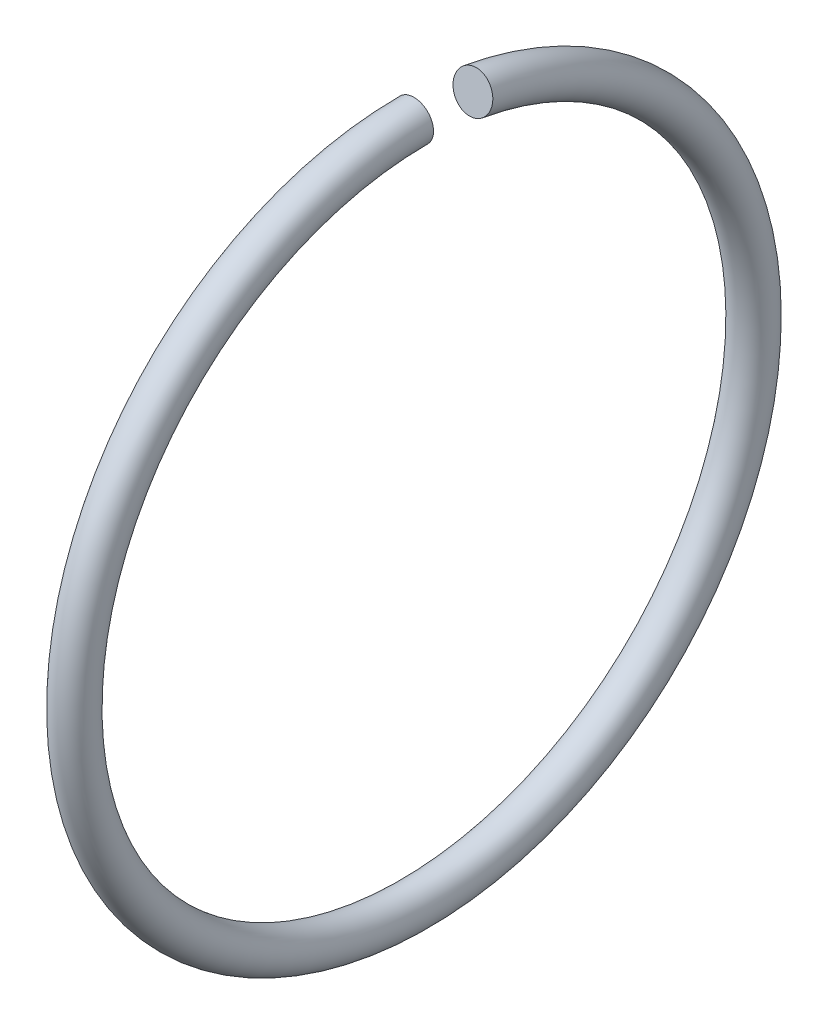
ISO-10303-21;
HEADER;
FILE_DESCRIPTION(('STEP AP214'),'2;1');
FILE_NAME('part.step','',(''),(''),'','','');
FILE_SCHEMA(('AUTOMOTIVE_DESIGN { 1 0 10303 214 1 1 1 1 }'));
ENDSEC;
DATA;
#1=APPLICATION_CONTEXT('core data for automotive mechanical design processes');
#2=APPLICATION_PROTOCOL_DEFINITION('international standard','automotive_design',2000,#1);
#3=PRODUCT_CONTEXT('',#1,'mechanical');
#4=PRODUCT('Part','Part','',(#3));
#5=PRODUCT_RELATED_PRODUCT_CATEGORY('part','',(#4));
#6=PRODUCT_DEFINITION_FORMATION('','',#4);
#7=PRODUCT_DEFINITION_CONTEXT('part definition',#1,'design');
#8=PRODUCT_DEFINITION('design','',#6,#7);
#9=PRODUCT_DEFINITION_SHAPE('','',#8);
#10=(LENGTH_UNIT() NAMED_UNIT(*) SI_UNIT(.MILLI.,.METRE.));
#11=(NAMED_UNIT(*) PLANE_ANGLE_UNIT() SI_UNIT($,.RADIAN.));
#12=(NAMED_UNIT(*) SI_UNIT($,.STERADIAN.) SOLID_ANGLE_UNIT());
#13=UNCERTAINTY_MEASURE_WITH_UNIT(LENGTH_MEASURE(1.E-05),#10,'distance_accuracy_value','');
#14=(GEOMETRIC_REPRESENTATION_CONTEXT(3) GLOBAL_UNCERTAINTY_ASSIGNED_CONTEXT((#13)) GLOBAL_UNIT_ASSIGNED_CONTEXT((#10,
#11,#12)) REPRESENTATION_CONTEXT('',''));
#15=CARTESIAN_POINT('',(0.,0.,0.));
#16=DIRECTION('',(0.,0.,1.));
#17=DIRECTION('',(1.,0.,0.));
#18=AXIS2_PLACEMENT_3D('',#15,#16,#17);
#19=CARTESIAN_POINT('',(0.75,0.,0.));
#20=DIRECTION('',(-1.,0.,0.));
#21=DIRECTION('',(0.,0.,1.));
#22=AXIS2_PLACEMENT_3D('',#19,#20,#21);
#23=TOROIDAL_SURFACE('',#22,12.9999999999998,0.75);
#24=CARTESIAN_POINT('',(0.75,12.8025007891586,-2.2574263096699));
#25=DIRECTION('',(0.,0.173648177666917,0.98480775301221));
#26=DIRECTION('',(1.,0.,0.));
#27=AXIS2_PLACEMENT_3D('',#24,#25,#26);
#28=CIRCLE('',#27,0.75);
#29=CARTESIAN_POINT('',(0.75,13.5411066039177,-2.38766244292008));
#30=VERTEX_POINT('',#29);
#31=EDGE_CURVE('E10',#30,#30,#28,.T.);
#32=CARTESIAN_POINT('',(0.75,12.9999999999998,0.));
#33=DIRECTION('',(0.,0.,1.));
#34=DIRECTION('',(1.,0.,0.));
#35=AXIS2_PLACEMENT_3D('',#32,#33,#34);
#36=CIRCLE('',#35,0.75);
#37=CARTESIAN_POINT('',(0.75,13.7499999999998,0.));
#38=VERTEX_POINT('',#37);
#39=EDGE_CURVE('E28',#38,#38,#36,.T.);
#40=CARTESIAN_POINT('',(0.75,0.,0.));
#41=DIRECTION('',(-1.,0.,0.));
#42=DIRECTION('',(0.,0.,1.));
#43=AXIS2_PLACEMENT_3D('',#40,#41,#42);
#44=CIRCLE('',#43,13.7499999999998);
#45=EDGE_CURVE('',#30,#38,#44,.T.);
#46=ORIENTED_EDGE('',*,*,#31,.F.);
#47=ORIENTED_EDGE('',*,*,#39,.T.);
#48=ORIENTED_EDGE('',*,*,#45,.T.);
#49=ORIENTED_EDGE('',*,*,#45,.F.);
#50=EDGE_LOOP('',(#46,#48,#47,#49));
#51=FACE_BOUND('',#50,.T.);
#52=ADVANCED_FACE('F22',(#51),#23,.T.);
#53=CARTESIAN_POINT('',(0.75,12.8025007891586,-2.2574263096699));
#54=DIRECTION('',(0.,0.173648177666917,0.98480775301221));
#55=DIRECTION('',(1.,0.,0.));
#56=AXIS2_PLACEMENT_3D('',#53,#54,#55);
#57=PLANE('',#56);
#58=ORIENTED_EDGE('',*,*,#31,.T.);
#59=EDGE_LOOP('',(#58));
#60=FACE_BOUND('',#59,.T.);
#61=ADVANCED_FACE('F37',(#60),#57,.T.);
#62=CARTESIAN_POINT('',(0.75,12.9999999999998,0.));
#63=DIRECTION('',(0.,0.,1.));
#64=DIRECTION('',(1.,0.,0.));
#65=AXIS2_PLACEMENT_3D('',#62,#63,#64);
#66=PLANE('',#65);
#67=ORIENTED_EDGE('',*,*,#39,.F.);
#68=EDGE_LOOP('',(#67));
#69=FACE_BOUND('',#68,.T.);
#70=ADVANCED_FACE('F35',(#69),#66,.F.);
#71=CLOSED_SHELL('',(#52,#61,#70));
#72=MANIFOLD_SOLID_BREP('B2',#71);
#73=ADVANCED_BREP_SHAPE_REPRESENTATION('',(#18,#72),#14);
#74=SHAPE_DEFINITION_REPRESENTATION(#9,#73);
ENDSEC;
END-ISO-10303-21;
